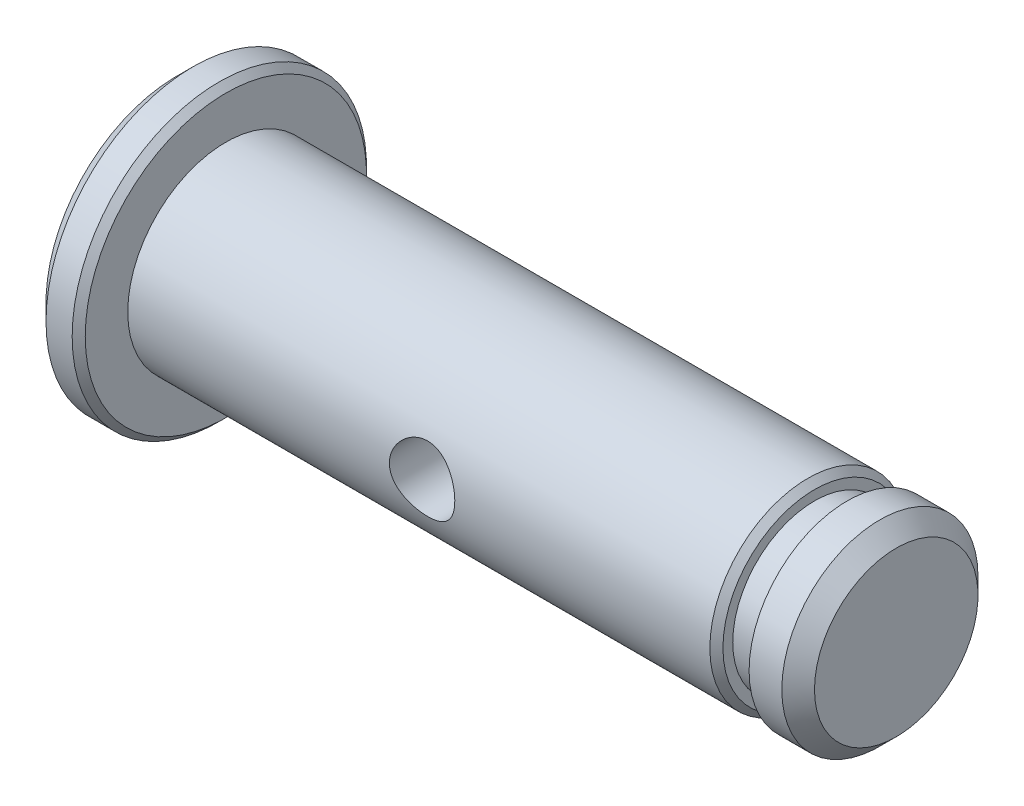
ISO-10303-21;
HEADER;
FILE_DESCRIPTION(('STEP AP214'),'2;1');
FILE_NAME('part.step','',(''),(''),'','','');
FILE_SCHEMA(('AUTOMOTIVE_DESIGN { 1 0 10303 214 1 1 1 1 }'));
ENDSEC;
DATA;
#1=APPLICATION_CONTEXT('core data for automotive mechanical design processes');
#2=APPLICATION_PROTOCOL_DEFINITION('international standard','automotive_design',2000,#1);
#3=PRODUCT_CONTEXT('',#1,'mechanical');
#4=PRODUCT('Part','Part','',(#3));
#5=PRODUCT_RELATED_PRODUCT_CATEGORY('part','',(#4));
#6=PRODUCT_DEFINITION_FORMATION('','',#4);
#7=PRODUCT_DEFINITION_CONTEXT('part definition',#1,'design');
#8=PRODUCT_DEFINITION('design','',#6,#7);
#9=PRODUCT_DEFINITION_SHAPE('','',#8);
#10=(LENGTH_UNIT() NAMED_UNIT(*) SI_UNIT(.MILLI.,.METRE.));
#11=(NAMED_UNIT(*) PLANE_ANGLE_UNIT() SI_UNIT($,.RADIAN.));
#12=(NAMED_UNIT(*) SI_UNIT($,.STERADIAN.) SOLID_ANGLE_UNIT());
#13=UNCERTAINTY_MEASURE_WITH_UNIT(LENGTH_MEASURE(1.E-05),#10,'distance_accuracy_value','');
#14=(GEOMETRIC_REPRESENTATION_CONTEXT(3) GLOBAL_UNCERTAINTY_ASSIGNED_CONTEXT((#13)) GLOBAL_UNIT_ASSIGNED_CONTEXT((#10,
#11,#12)) REPRESENTATION_CONTEXT('',''));
#15=CARTESIAN_POINT('',(0.,0.,0.));
#16=DIRECTION('',(0.,0.,1.));
#17=DIRECTION('',(1.,0.,0.));
#18=AXIS2_PLACEMENT_3D('',#15,#16,#17);
#19=CARTESIAN_POINT('',(0.,0.,0.));
#20=DIRECTION('',(1.,0.,0.));
#21=DIRECTION('',(0.,0.,-1.));
#22=AXIS2_PLACEMENT_3D('',#19,#20,#21);
#23=PLANE('',#22);
#24=CARTESIAN_POINT('',(0.,0.,0.));
#25=DIRECTION('',(1.,0.,0.));
#26=DIRECTION('',(0.,0.,-1.));
#27=AXIS2_PLACEMENT_3D('',#24,#25,#26);
#28=CIRCLE('',#27,4.);
#29=CARTESIAN_POINT('',(0.,0.,-4.));
#30=VERTEX_POINT('',#29);
#31=EDGE_CURVE('E150',#30,#30,#28,.F.);
#32=ORIENTED_EDGE('',*,*,#31,.T.);
#33=EDGE_LOOP('',(#32));
#34=FACE_BOUND('',#33,.T.);
#35=ADVANCED_FACE('F33',(#34),#23,.F.);
#36=CARTESIAN_POINT('',(0.,0.,0.));
#37=DIRECTION('',(-1.,0.,0.));
#38=DIRECTION('',(0.,0.,1.));
#39=AXIS2_PLACEMENT_3D('',#36,#37,#38);
#40=CYLINDRICAL_SURFACE('',#39,4.5);
#41=CARTESIAN_POINT('',(1.30000000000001,0.,0.));
#42=DIRECTION('',(-1.,0.,0.));
#43=DIRECTION('',(0.,0.,1.));
#44=AXIS2_PLACEMENT_3D('',#41,#42,#43);
#45=CIRCLE('',#44,4.5);
#46=CARTESIAN_POINT('',(1.30000000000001,0.,4.5));
#47=VERTEX_POINT('',#46);
#48=EDGE_CURVE('E40',#47,#47,#45,.T.);
#49=ORIENTED_EDGE('',*,*,#48,.T.);
#50=EDGE_LOOP('',(#49));
#51=FACE_BOUND('',#50,.T.);
#52=CARTESIAN_POINT('',(0.500000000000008,0.,0.));
#53=DIRECTION('',(1.,0.,0.));
#54=DIRECTION('',(0.,0.,-1.));
#55=AXIS2_PLACEMENT_3D('',#52,#53,#54);
#56=CIRCLE('',#55,4.5);
#57=CARTESIAN_POINT('',(0.500000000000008,0.,-4.5));
#58=VERTEX_POINT('',#57);
#59=EDGE_CURVE('E53',#58,#58,#56,.T.);
#60=ORIENTED_EDGE('',*,*,#59,.T.);
#61=EDGE_LOOP('',(#60));
#62=FACE_BOUND('',#61,.T.);
#63=ADVANCED_FACE('F104',(#51,#62),#40,.T.);
#64=CARTESIAN_POINT('',(1.5,4.5,0.));
#65=DIRECTION('',(-1.,0.,0.));
#66=DIRECTION('',(0.,0.,1.));
#67=AXIS2_PLACEMENT_3D('',#64,#65,#66);
#68=PLANE('',#67);
#69=CARTESIAN_POINT('',(1.5,0.,0.));
#70=DIRECTION('',(-1.,0.,0.));
#71=DIRECTION('',(0.,0.,1.));
#72=AXIS2_PLACEMENT_3D('',#69,#70,#71);
#73=CIRCLE('',#72,4.3);
#74=CARTESIAN_POINT('',(1.5,0.,4.3));
#75=VERTEX_POINT('',#74);
#76=EDGE_CURVE('E10',#75,#75,#73,.F.);
#77=ORIENTED_EDGE('',*,*,#76,.T.);
#78=EDGE_LOOP('',(#77));
#79=FACE_BOUND('',#78,.T.);
#80=CARTESIAN_POINT('',(1.5,0.,0.));
#81=DIRECTION('',(-1.,0.,0.));
#82=DIRECTION('',(0.,0.,1.));
#83=AXIS2_PLACEMENT_3D('',#80,#81,#82);
#84=CIRCLE('',#83,3.);
#85=CARTESIAN_POINT('',(1.5,0.,3.));
#86=VERTEX_POINT('',#85);
#87=EDGE_CURVE('E135',#86,#86,#84,.T.);
#88=ORIENTED_EDGE('',*,*,#87,.T.);
#89=EDGE_LOOP('',(#88));
#90=FACE_BOUND('',#89,.T.);
#91=ADVANCED_FACE('F100',(#79,#90),#68,.F.);
#92=CARTESIAN_POINT('',(0.,0.,0.));
#93=DIRECTION('',(-1.,0.,0.));
#94=DIRECTION('',(0.,0.,1.));
#95=AXIS2_PLACEMENT_3D('',#92,#93,#94);
#96=CYLINDRICAL_SURFACE('',#95,3.);
#97=CARTESIAN_POINT('',(19.3,0.,0.));
#98=DIRECTION('',(-1.,0.,0.));
#99=DIRECTION('',(0.,0.,1.));
#100=AXIS2_PLACEMENT_3D('',#97,#98,#99);
#101=CIRCLE('',#100,3.);
#102=CARTESIAN_POINT('',(19.3,0.,3.));
#103=VERTEX_POINT('',#102);
#104=EDGE_CURVE('E48',#103,#103,#101,.T.);
#105=ORIENTED_EDGE('',*,*,#104,.T.);
#106=EDGE_LOOP('',(#105));
#107=FACE_BOUND('',#106,.T.);
#108=CARTESIAN_POINT('',(11.5,0.,3.));
#109=CARTESIAN_POINT('',(11.5000002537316,-0.0545633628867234,3.00000015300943));
#110=CARTESIAN_POINT('',(11.4955197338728,-0.10912519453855,2.99849769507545));
#111=CARTESIAN_POINT('',(11.4777708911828,-0.216641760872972,2.99265210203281));
#112=CARTESIAN_POINT('',(11.4645016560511,-0.269596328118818,2.98830867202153));
#113=CARTESIAN_POINT('',(11.429680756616,-0.372332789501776,2.97725307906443));
#114=CARTESIAN_POINT('',(11.4081429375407,-0.422119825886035,2.97054487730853));
#115=CARTESIAN_POINT('',(11.3574588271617,-0.517374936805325,2.95544445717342));
#116=CARTESIAN_POINT('',(11.3283110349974,-0.562842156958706,2.94705190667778));
#117=CARTESIAN_POINT('',(11.2621741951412,-0.649741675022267,2.92914094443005));
#118=CARTESIAN_POINT('',(11.2249687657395,-0.691003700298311,2.91959556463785));
#119=CARTESIAN_POINT('',(11.1442328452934,-0.766832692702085,2.90060314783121));
#120=CARTESIAN_POINT('',(11.1007009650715,-0.801398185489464,2.89115613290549));
#121=CARTESIAN_POINT('',(11.0070148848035,-0.86382494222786,2.87313332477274));
#122=CARTESIAN_POINT('',(10.9567062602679,-0.891464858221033,2.86459039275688));
#123=CARTESIAN_POINT('',(10.8518239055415,-0.937818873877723,2.84975305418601));
#124=CARTESIAN_POINT('',(10.7972514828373,-0.956535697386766,2.84345796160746));
#125=CARTESIAN_POINT('',(10.6873267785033,-0.983873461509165,2.83411303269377));
#126=CARTESIAN_POINT('',(10.6320627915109,-0.992813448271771,2.83096095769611));
#127=CARTESIAN_POINT('',(10.5207362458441,-1.00134112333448,2.82795656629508));
#128=CARTESIAN_POINT('',(10.4646739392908,-1.00093170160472,2.8281032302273));
#129=CARTESIAN_POINT('',(10.356063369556,-0.99101990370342,2.8315901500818));
#130=CARTESIAN_POINT('',(10.303471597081,-0.981933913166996,2.83478415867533));
#131=CARTESIAN_POINT('',(10.2006065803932,-0.955606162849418,2.84376657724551));
#132=CARTESIAN_POINT('',(10.1503336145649,-0.938363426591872,2.84955529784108));
#133=CARTESIAN_POINT('',(10.0525872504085,-0.895939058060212,2.86317911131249));
#134=CARTESIAN_POINT('',(10.0051719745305,-0.870634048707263,2.87104565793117));
#135=CARTESIAN_POINT('',(9.91512909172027,-0.81288910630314,2.88792558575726));
#136=CARTESIAN_POINT('',(9.87250287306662,-0.780447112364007,2.89693929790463));
#137=CARTESIAN_POINT('',(9.79090840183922,-0.707349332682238,2.91567329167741));
#138=CARTESIAN_POINT('',(9.75224730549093,-0.666353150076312,2.92540589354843));
#139=CARTESIAN_POINT('',(9.6822687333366,-0.578339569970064,2.94406938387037));
#140=CARTESIAN_POINT('',(9.6509519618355,-0.531321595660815,2.95300019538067));
#141=CARTESIAN_POINT('',(9.59630369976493,-0.431947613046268,2.96917107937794));
#142=CARTESIAN_POINT('',(9.57305450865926,-0.379543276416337,2.97639350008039));
#143=CARTESIAN_POINT('',(9.53579682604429,-0.271269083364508,2.98820567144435));
#144=CARTESIAN_POINT('',(9.52178512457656,-0.215400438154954,2.99279633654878));
#145=CARTESIAN_POINT('',(9.50394433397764,-0.104383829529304,2.99867627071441));
#146=CARTESIAN_POINT('',(9.49970019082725,-0.0493095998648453,3.00010001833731));
#147=CARTESIAN_POINT('',(9.50033267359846,0.0607750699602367,2.99988902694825));
#148=CARTESIAN_POINT('',(9.50520775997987,0.115785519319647,2.99825480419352));
#149=CARTESIAN_POINT('',(9.52361190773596,0.22251986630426,2.99220024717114));
#150=CARTESIAN_POINT('',(9.53688620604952,0.274292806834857,2.98786198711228));
#151=CARTESIAN_POINT('',(9.5713934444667,0.374855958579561,2.97691846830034));
#152=CARTESIAN_POINT('',(9.59262739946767,0.42364578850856,2.97031292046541));
#153=CARTESIAN_POINT('',(9.6430704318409,0.518288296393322,2.95528931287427));
#154=CARTESIAN_POINT('',(9.6724745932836,0.564029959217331,2.94682814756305));
#155=CARTESIAN_POINT('',(9.73819415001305,0.650064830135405,2.92905253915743));
#156=CARTESIAN_POINT('',(9.77451165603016,0.690356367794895,2.91973783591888));
#157=CARTESIAN_POINT('',(9.85497875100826,0.766252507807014,2.90076847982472));
#158=CARTESIAN_POINT('',(9.89940922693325,0.801560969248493,2.89111761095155));
#159=CARTESIAN_POINT('',(9.9937715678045,0.864257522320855,2.87299973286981));
#160=CARTESIAN_POINT('',(10.0437034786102,0.891645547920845,2.8645327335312));
#161=CARTESIAN_POINT('',(10.1476730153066,0.937596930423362,2.84982391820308));
#162=CARTESIAN_POINT('',(10.2017020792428,0.956178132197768,2.84357760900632));
#163=CARTESIAN_POINT('',(10.3123786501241,0.983894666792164,2.83410832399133));
#164=CARTESIAN_POINT('',(10.3690249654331,0.993034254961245,2.83088398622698));
#165=CARTESIAN_POINT('',(10.4801970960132,1.00127628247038,2.82797858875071));
#166=CARTESIAN_POINT('',(10.5346823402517,1.00087025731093,2.82812400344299));
#167=CARTESIAN_POINT('',(10.6427650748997,0.991242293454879,2.8315126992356));
#168=CARTESIAN_POINT('',(10.6963626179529,0.982020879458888,2.83475579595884));
#169=CARTESIAN_POINT('',(10.8001356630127,0.955371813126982,2.84384524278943));
#170=CARTESIAN_POINT('',(10.8503568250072,0.938103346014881,2.84964098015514));
#171=CARTESIAN_POINT('',(10.9472274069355,0.895979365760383,2.86316398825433));
#172=CARTESIAN_POINT('',(10.9938760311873,0.871122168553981,2.87089168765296));
#173=CARTESIAN_POINT('',(11.0844836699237,0.813260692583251,2.8878282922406));
#174=CARTESIAN_POINT('',(11.1282365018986,0.779948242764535,2.89708711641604));
#175=CARTESIAN_POINT('',(11.209689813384,0.706642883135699,2.91583356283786));
#176=CARTESIAN_POINT('',(11.247388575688,0.666648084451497,2.92532124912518));
#177=CARTESIAN_POINT('',(11.3171444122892,0.579241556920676,2.94390030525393));
#178=CARTESIAN_POINT('',(11.348924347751,0.531601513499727,2.95296181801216));
#179=CARTESIAN_POINT('',(11.4039904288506,0.43135735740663,2.96925991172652));
#180=CARTESIAN_POINT('',(11.427278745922,0.37875451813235,2.9764969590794));
#181=CARTESIAN_POINT('',(11.4637216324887,0.272493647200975,2.98805515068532));
#182=CARTESIAN_POINT('',(11.4772824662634,0.218987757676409,2.9924921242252));
#183=CARTESIAN_POINT('',(11.4954202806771,0.110320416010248,2.99846407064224));
#184=CARTESIAN_POINT('',(11.4999997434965,0.0551594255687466,2.99999984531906));
#185=CARTESIAN_POINT('',(11.5,0.,3.));
#186=B_SPLINE_CURVE_WITH_KNOTS('',3,(#108,#109,#110,#111,#112,#113,#114,#115,#116,#117,#118,
#119,#120,#121,#122,#123,#124,#125,#126,#127,#128,#129,#130,#131,#132,#133,#134,#135,#136,#137,
#138,#139,#140,#141,#142,#143,#144,#145,#146,#147,#148,#149,#150,#151,#152,#153,#154,#155,#156,
#157,#158,#159,#160,#161,#162,#163,#164,#165,#166,#167,#168,#169,#170,#171,#172,#173,#174,#175,
#176,#177,#178,#179,#180,#181,#182,#183,#184,#185),.UNSPECIFIED.,.T.,.F.,(4,2,2,2,2,2,2,2,2,2,2,
2,2,2,2,2,2,2,2,2,2,2,2,2,2,2,2,2,2,2,2,2,2,2,2,2,2,2,4),(0.,0.163487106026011,
0.326991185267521,0.490222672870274,0.653486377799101,0.821846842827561,0.990244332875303,
1.16348384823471,1.33667044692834,1.5040192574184,1.67131633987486,1.83096826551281,
1.99063930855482,2.15288171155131,2.31517102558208,2.48593305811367,2.65671145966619,
2.82918405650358,3.00159668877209,3.1665358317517,3.33144713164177,3.49158157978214,
3.65173645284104,3.81610399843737,3.98052180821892,4.15241022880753,4.32430008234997,
4.49584013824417,4.66730284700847,4.82995666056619,4.99260079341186,5.15215587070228,
5.31174638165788,5.47830066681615,5.6449021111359,5.81799660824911,5.99104681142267,
6.15636558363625,6.32163866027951),.UNSPECIFIED.);
#187=CARTESIAN_POINT('',(11.5,0.,3.));
#188=VERTEX_POINT('',#187);
#189=EDGE_CURVE('E54',#188,#188,#186,.T.);
#190=ORIENTED_EDGE('',*,*,#189,.T.);
#191=EDGE_LOOP('',(#190));
#192=FACE_BOUND('',#191,.T.);
#193=CARTESIAN_POINT('',(11.5,0.,-3.));
#194=CARTESIAN_POINT('',(11.5000002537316,0.0545633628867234,-3.00000015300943));
#195=CARTESIAN_POINT('',(11.4955197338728,0.10912519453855,-2.99849769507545));
#196=CARTESIAN_POINT('',(11.4777708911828,0.216641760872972,-2.99265210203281));
#197=CARTESIAN_POINT('',(11.4645016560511,0.269596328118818,-2.98830867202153));
#198=CARTESIAN_POINT('',(11.429680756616,0.372332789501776,-2.97725307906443));
#199=CARTESIAN_POINT('',(11.4081429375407,0.422119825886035,-2.97054487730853));
#200=CARTESIAN_POINT('',(11.3574588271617,0.517374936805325,-2.95544445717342));
#201=CARTESIAN_POINT('',(11.3283110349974,0.562842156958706,-2.94705190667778));
#202=CARTESIAN_POINT('',(11.2621741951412,0.649741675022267,-2.92914094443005));
#203=CARTESIAN_POINT('',(11.2249687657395,0.691003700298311,-2.91959556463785));
#204=CARTESIAN_POINT('',(11.1442328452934,0.766832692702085,-2.90060314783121));
#205=CARTESIAN_POINT('',(11.1007009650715,0.801398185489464,-2.89115613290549));
#206=CARTESIAN_POINT('',(11.0070148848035,0.86382494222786,-2.87313332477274));
#207=CARTESIAN_POINT('',(10.9567062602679,0.891464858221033,-2.86459039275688));
#208=CARTESIAN_POINT('',(10.8518239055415,0.937818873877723,-2.84975305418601));
#209=CARTESIAN_POINT('',(10.7972514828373,0.956535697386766,-2.84345796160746));
#210=CARTESIAN_POINT('',(10.6873267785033,0.983873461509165,-2.83411303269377));
#211=CARTESIAN_POINT('',(10.6320627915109,0.992813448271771,-2.83096095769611));
#212=CARTESIAN_POINT('',(10.5207362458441,1.00134112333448,-2.82795656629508));
#213=CARTESIAN_POINT('',(10.4646739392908,1.00093170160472,-2.8281032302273));
#214=CARTESIAN_POINT('',(10.356063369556,0.99101990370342,-2.8315901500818));
#215=CARTESIAN_POINT('',(10.303471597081,0.981933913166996,-2.83478415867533));
#216=CARTESIAN_POINT('',(10.2006065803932,0.955606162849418,-2.84376657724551));
#217=CARTESIAN_POINT('',(10.1503336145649,0.938363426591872,-2.84955529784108));
#218=CARTESIAN_POINT('',(10.0525872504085,0.895939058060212,-2.86317911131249));
#219=CARTESIAN_POINT('',(10.0051719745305,0.870634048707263,-2.87104565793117));
#220=CARTESIAN_POINT('',(9.91512909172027,0.81288910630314,-2.88792558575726));
#221=CARTESIAN_POINT('',(9.87250287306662,0.780447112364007,-2.89693929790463));
#222=CARTESIAN_POINT('',(9.79090840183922,0.707349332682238,-2.91567329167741));
#223=CARTESIAN_POINT('',(9.75224730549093,0.666353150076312,-2.92540589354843));
#224=CARTESIAN_POINT('',(9.6822687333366,0.578339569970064,-2.94406938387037));
#225=CARTESIAN_POINT('',(9.6509519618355,0.531321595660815,-2.95300019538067));
#226=CARTESIAN_POINT('',(9.59630369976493,0.431947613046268,-2.96917107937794));
#227=CARTESIAN_POINT('',(9.57305450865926,0.379543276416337,-2.97639350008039));
#228=CARTESIAN_POINT('',(9.53579682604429,0.271269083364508,-2.98820567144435));
#229=CARTESIAN_POINT('',(9.52178512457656,0.215400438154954,-2.99279633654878));
#230=CARTESIAN_POINT('',(9.50394433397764,0.104383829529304,-2.99867627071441));
#231=CARTESIAN_POINT('',(9.49970019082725,0.0493095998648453,-3.00010001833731));
#232=CARTESIAN_POINT('',(9.50033267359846,-0.0607750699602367,-2.99988902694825));
#233=CARTESIAN_POINT('',(9.50520775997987,-0.115785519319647,-2.99825480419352));
#234=CARTESIAN_POINT('',(9.52361190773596,-0.22251986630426,-2.99220024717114));
#235=CARTESIAN_POINT('',(9.53688620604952,-0.274292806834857,-2.98786198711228));
#236=CARTESIAN_POINT('',(9.5713934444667,-0.374855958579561,-2.97691846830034));
#237=CARTESIAN_POINT('',(9.59262739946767,-0.42364578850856,-2.97031292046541));
#238=CARTESIAN_POINT('',(9.6430704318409,-0.518288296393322,-2.95528931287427));
#239=CARTESIAN_POINT('',(9.6724745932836,-0.564029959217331,-2.94682814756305));
#240=CARTESIAN_POINT('',(9.73819415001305,-0.650064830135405,-2.92905253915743));
#241=CARTESIAN_POINT('',(9.77451165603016,-0.690356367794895,-2.91973783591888));
#242=CARTESIAN_POINT('',(9.85497875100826,-0.766252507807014,-2.90076847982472));
#243=CARTESIAN_POINT('',(9.89940922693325,-0.801560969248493,-2.89111761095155));
#244=CARTESIAN_POINT('',(9.9937715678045,-0.864257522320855,-2.87299973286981));
#245=CARTESIAN_POINT('',(10.0437034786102,-0.891645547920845,-2.8645327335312));
#246=CARTESIAN_POINT('',(10.1476730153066,-0.937596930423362,-2.84982391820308));
#247=CARTESIAN_POINT('',(10.2017020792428,-0.956178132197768,-2.84357760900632));
#248=CARTESIAN_POINT('',(10.3123786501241,-0.983894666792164,-2.83410832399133));
#249=CARTESIAN_POINT('',(10.3690249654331,-0.993034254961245,-2.83088398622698));
#250=CARTESIAN_POINT('',(10.4801970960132,-1.00127628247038,-2.82797858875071));
#251=CARTESIAN_POINT('',(10.5346823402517,-1.00087025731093,-2.82812400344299));
#252=CARTESIAN_POINT('',(10.6427650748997,-0.991242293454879,-2.8315126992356));
#253=CARTESIAN_POINT('',(10.6963626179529,-0.982020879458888,-2.83475579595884));
#254=CARTESIAN_POINT('',(10.8001356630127,-0.955371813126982,-2.84384524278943));
#255=CARTESIAN_POINT('',(10.8503568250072,-0.938103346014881,-2.84964098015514));
#256=CARTESIAN_POINT('',(10.9472274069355,-0.895979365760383,-2.86316398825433));
#257=CARTESIAN_POINT('',(10.9938760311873,-0.871122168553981,-2.87089168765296));
#258=CARTESIAN_POINT('',(11.0844836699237,-0.813260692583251,-2.8878282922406));
#259=CARTESIAN_POINT('',(11.1282365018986,-0.779948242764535,-2.89708711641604));
#260=CARTESIAN_POINT('',(11.209689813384,-0.706642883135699,-2.91583356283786));
#261=CARTESIAN_POINT('',(11.247388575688,-0.666648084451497,-2.92532124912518));
#262=CARTESIAN_POINT('',(11.3171444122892,-0.579241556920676,-2.94390030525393));
#263=CARTESIAN_POINT('',(11.348924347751,-0.531601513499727,-2.95296181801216));
#264=CARTESIAN_POINT('',(11.4039904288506,-0.43135735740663,-2.96925991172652));
#265=CARTESIAN_POINT('',(11.427278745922,-0.37875451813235,-2.9764969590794));
#266=CARTESIAN_POINT('',(11.4637216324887,-0.272493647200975,-2.98805515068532));
#267=CARTESIAN_POINT('',(11.4772824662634,-0.218987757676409,-2.9924921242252));
#268=CARTESIAN_POINT('',(11.4954202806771,-0.110320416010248,-2.99846407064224));
#269=CARTESIAN_POINT('',(11.4999997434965,-0.0551594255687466,-2.99999984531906));
#270=CARTESIAN_POINT('',(11.5,0.,-3.));
#271=B_SPLINE_CURVE_WITH_KNOTS('',3,(#193,#194,#195,#196,#197,#198,#199,#200,#201,#202,#203,
#204,#205,#206,#207,#208,#209,#210,#211,#212,#213,#214,#215,#216,#217,#218,#219,#220,#221,#222,
#223,#224,#225,#226,#227,#228,#229,#230,#231,#232,#233,#234,#235,#236,#237,#238,#239,#240,#241,
#242,#243,#244,#245,#246,#247,#248,#249,#250,#251,#252,#253,#254,#255,#256,#257,#258,#259,#260,
#261,#262,#263,#264,#265,#266,#267,#268,#269,#270),.UNSPECIFIED.,.T.,.F.,(4,2,2,2,2,2,2,2,2,2,2,
2,2,2,2,2,2,2,2,2,2,2,2,2,2,2,2,2,2,2,2,2,2,2,2,2,2,2,4),(0.,0.163487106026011,
0.326991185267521,0.490222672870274,0.653486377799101,0.821846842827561,0.990244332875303,
1.16348384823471,1.33667044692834,1.5040192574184,1.67131633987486,1.83096826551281,
1.99063930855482,2.15288171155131,2.31517102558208,2.48593305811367,2.65671145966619,
2.82918405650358,3.00159668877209,3.1665358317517,3.33144713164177,3.49158157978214,
3.65173645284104,3.81610399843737,3.98052180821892,4.15241022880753,4.32430008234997,
4.49584013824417,4.66730284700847,4.82995666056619,4.99260079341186,5.15215587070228,
5.31174638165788,5.47830066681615,5.6449021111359,5.81799660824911,5.99104681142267,
6.15636558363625,6.32163866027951),.UNSPECIFIED.);
#272=CARTESIAN_POINT('',(11.5,0.,-3.));
#273=VERTEX_POINT('',#272);
#274=EDGE_CURVE('E62',#273,#273,#271,.T.);
#275=ORIENTED_EDGE('',*,*,#274,.T.);
#276=EDGE_LOOP('',(#275));
#277=FACE_BOUND('',#276,.T.);
#278=ORIENTED_EDGE('',*,*,#87,.F.);
#279=EDGE_LOOP('',(#278));
#280=FACE_BOUND('',#279,.T.);
#281=ADVANCED_FACE('F66',(#107,#192,#277,#280),#96,.T.);
#282=CARTESIAN_POINT('',(19.5,3.,0.));
#283=DIRECTION('',(-1.,0.,0.));
#284=DIRECTION('',(0.,0.,1.));
#285=AXIS2_PLACEMENT_3D('',#282,#283,#284);
#286=PLANE('',#285);
#287=CARTESIAN_POINT('',(19.5,0.,0.));
#288=DIRECTION('',(-1.,0.,0.));
#289=DIRECTION('',(0.,0.,1.));
#290=AXIS2_PLACEMENT_3D('',#287,#288,#289);
#291=CIRCLE('',#290,2.79999999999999);
#292=CARTESIAN_POINT('',(19.5,0.,2.79999999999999));
#293=VERTEX_POINT('',#292);
#294=EDGE_CURVE('E44',#293,#293,#291,.F.);
#295=ORIENTED_EDGE('',*,*,#294,.T.);
#296=EDGE_LOOP('',(#295));
#297=FACE_BOUND('',#296,.T.);
#298=CARTESIAN_POINT('',(19.5,0.,0.));
#299=DIRECTION('',(-1.,0.,0.));
#300=DIRECTION('',(0.,0.,1.));
#301=AXIS2_PLACEMENT_3D('',#298,#299,#300);
#302=CIRCLE('',#301,2.5);
#303=CARTESIAN_POINT('',(19.5,0.,2.5));
#304=VERTEX_POINT('',#303);
#305=EDGE_CURVE('E138',#304,#304,#302,.T.);
#306=ORIENTED_EDGE('',*,*,#305,.T.);
#307=EDGE_LOOP('',(#306));
#308=FACE_BOUND('',#307,.T.);
#309=ADVANCED_FACE('F93',(#297,#308),#286,.F.);
#310=CARTESIAN_POINT('',(0.,0.,0.));
#311=DIRECTION('',(-1.,0.,0.));
#312=DIRECTION('',(0.,0.,1.));
#313=AXIS2_PLACEMENT_3D('',#310,#311,#312);
#314=CYLINDRICAL_SURFACE('',#313,2.5);
#315=ORIENTED_EDGE('',*,*,#305,.F.);
#316=EDGE_LOOP('',(#315));
#317=FACE_BOUND('',#316,.T.);
#318=CARTESIAN_POINT('',(20.5,0.,0.));
#319=DIRECTION('',(-1.,0.,0.));
#320=DIRECTION('',(0.,0.,1.));
#321=AXIS2_PLACEMENT_3D('',#318,#319,#320);
#322=CIRCLE('',#321,2.5);
#323=CARTESIAN_POINT('',(20.5,0.,2.5));
#324=VERTEX_POINT('',#323);
#325=EDGE_CURVE('E144',#324,#324,#322,.T.);
#326=ORIENTED_EDGE('',*,*,#325,.T.);
#327=EDGE_LOOP('',(#326));
#328=FACE_BOUND('',#327,.T.);
#329=ADVANCED_FACE('F90',(#317,#328),#314,.T.);
#330=CARTESIAN_POINT('',(20.5,2.5,0.));
#331=DIRECTION('',(1.,0.,0.));
#332=DIRECTION('',(0.,0.,-1.));
#333=AXIS2_PLACEMENT_3D('',#330,#331,#332);
#334=PLANE('',#333);
#335=ORIENTED_EDGE('',*,*,#325,.F.);
#336=EDGE_LOOP('',(#335));
#337=FACE_BOUND('',#336,.T.);
#338=CARTESIAN_POINT('',(20.5,0.,0.));
#339=DIRECTION('',(-1.,0.,0.));
#340=DIRECTION('',(0.,0.,1.));
#341=AXIS2_PLACEMENT_3D('',#338,#339,#340);
#342=CIRCLE('',#341,3.);
#343=CARTESIAN_POINT('',(20.5,0.,3.));
#344=VERTEX_POINT('',#343);
#345=EDGE_CURVE('E61',#344,#344,#342,.T.);
#346=ORIENTED_EDGE('',*,*,#345,.T.);
#347=EDGE_LOOP('',(#346));
#348=FACE_BOUND('',#347,.T.);
#349=ADVANCED_FACE('F86',(#337,#348),#334,.F.);
#350=CARTESIAN_POINT('',(0.,0.,0.));
#351=DIRECTION('',(-1.,0.,0.));
#352=DIRECTION('',(0.,0.,1.));
#353=AXIS2_PLACEMENT_3D('',#350,#351,#352);
#354=CYLINDRICAL_SURFACE('',#353,3.);
#355=CARTESIAN_POINT('',(21.5,0.,0.));
#356=DIRECTION('',(-1.,0.,0.));
#357=DIRECTION('',(0.,0.,1.));
#358=AXIS2_PLACEMENT_3D('',#355,#356,#357);
#359=CIRCLE('',#358,3.);
#360=CARTESIAN_POINT('',(21.5,0.,3.));
#361=VERTEX_POINT('',#360);
#362=EDGE_CURVE('E137',#361,#361,#359,.T.);
#363=ORIENTED_EDGE('',*,*,#362,.T.);
#364=EDGE_LOOP('',(#363));
#365=FACE_BOUND('',#364,.T.);
#366=ORIENTED_EDGE('',*,*,#345,.F.);
#367=EDGE_LOOP('',(#366));
#368=FACE_BOUND('',#367,.T.);
#369=ADVANCED_FACE('F82',(#365,#368),#354,.T.);
#370=CARTESIAN_POINT('',(22.,3.,0.));
#371=DIRECTION('',(-1.,0.,0.));
#372=DIRECTION('',(0.,0.,1.));
#373=AXIS2_PLACEMENT_3D('',#370,#371,#372);
#374=PLANE('',#373);
#375=CARTESIAN_POINT('',(22.,0.,0.));
#376=DIRECTION('',(-1.,0.,0.));
#377=DIRECTION('',(0.,0.,1.));
#378=AXIS2_PLACEMENT_3D('',#375,#376,#377);
#379=CIRCLE('',#378,2.5);
#380=CARTESIAN_POINT('',(22.,0.,2.5));
#381=VERTEX_POINT('',#380);
#382=EDGE_CURVE('E141',#381,#381,#379,.F.);
#383=ORIENTED_EDGE('',*,*,#382,.T.);
#384=EDGE_LOOP('',(#383));
#385=FACE_BOUND('',#384,.T.);
#386=ADVANCED_FACE('F77',(#385),#374,.F.);
#387=CARTESIAN_POINT('',(21.5,0.,0.));
#388=DIRECTION('',(-1.,0.,0.));
#389=DIRECTION('',(0.,0.,1.));
#390=AXIS2_PLACEMENT_3D('',#387,#388,#389);
#391=CONICAL_SURFACE('',#390,3.,0.785398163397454);
#392=ORIENTED_EDGE('',*,*,#382,.F.);
#393=EDGE_LOOP('',(#392));
#394=FACE_BOUND('',#393,.T.);
#395=ORIENTED_EDGE('',*,*,#362,.F.);
#396=EDGE_LOOP('',(#395));
#397=FACE_BOUND('',#396,.T.);
#398=ADVANCED_FACE('F81',(#394,#397),#391,.T.);
#399=CARTESIAN_POINT('',(0.,0.,0.));
#400=DIRECTION('',(1.,0.,0.));
#401=DIRECTION('',(0.,0.,-1.));
#402=AXIS2_PLACEMENT_3D('',#399,#400,#401);
#403=CONICAL_SURFACE('',#402,4.,0.785398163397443);
#404=ORIENTED_EDGE('',*,*,#59,.F.);
#405=EDGE_LOOP('',(#404));
#406=FACE_BOUND('',#405,.T.);
#407=ORIENTED_EDGE('',*,*,#31,.F.);
#408=EDGE_LOOP('',(#407));
#409=FACE_BOUND('',#408,.T.);
#410=ADVANCED_FACE('F75',(#406,#409),#403,.T.);
#411=CARTESIAN_POINT('',(10.5,0.,-15.));
#412=DIRECTION('',(0.,0.,1.));
#413=DIRECTION('',(1.,0.,0.));
#414=AXIS2_PLACEMENT_3D('',#411,#412,#413);
#415=CYLINDRICAL_SURFACE('',#414,1.);
#416=ORIENTED_EDGE('',*,*,#274,.F.);
#417=EDGE_LOOP('',(#416));
#418=FACE_BOUND('',#417,.T.);
#419=ORIENTED_EDGE('',*,*,#189,.F.);
#420=EDGE_LOOP('',(#419));
#421=FACE_BOUND('',#420,.T.);
#422=ADVANCED_FACE('F70',(#418,#421),#415,.F.);
#423=CARTESIAN_POINT('',(19.3,0.,0.));
#424=DIRECTION('',(-1.,0.,0.));
#425=DIRECTION('',(0.,0.,1.));
#426=AXIS2_PLACEMENT_3D('',#423,#424,#425);
#427=CONICAL_SURFACE('',#426,3.,0.785398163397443);
#428=ORIENTED_EDGE('',*,*,#294,.F.);
#429=EDGE_LOOP('',(#428));
#430=FACE_BOUND('',#429,.T.);
#431=ORIENTED_EDGE('',*,*,#104,.F.);
#432=EDGE_LOOP('',(#431));
#433=FACE_BOUND('',#432,.T.);
#434=ADVANCED_FACE('F74',(#430,#433),#427,.T.);
#435=CARTESIAN_POINT('',(1.30000000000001,0.,0.));
#436=DIRECTION('',(-1.,0.,0.));
#437=DIRECTION('',(0.,0.,1.));
#438=AXIS2_PLACEMENT_3D('',#435,#436,#437);
#439=CONICAL_SURFACE('',#438,4.5,0.785398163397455);
#440=ORIENTED_EDGE('',*,*,#76,.F.);
#441=EDGE_LOOP('',(#440));
#442=FACE_BOUND('',#441,.T.);
#443=ORIENTED_EDGE('',*,*,#48,.F.);
#444=EDGE_LOOP('',(#443));
#445=FACE_BOUND('',#444,.T.);
#446=ADVANCED_FACE('F35',(#442,#445),#439,.T.);
#447=CLOSED_SHELL('',(#35,#63,#91,#281,#309,#329,#349,#369,#386,#398,#410,#422,#434,#446));
#448=MANIFOLD_SOLID_BREP('B2',#447);
#449=ADVANCED_BREP_SHAPE_REPRESENTATION('',(#18,#448),#14);
#450=SHAPE_DEFINITION_REPRESENTATION(#9,#449);
ENDSEC;
END-ISO-10303-21;
